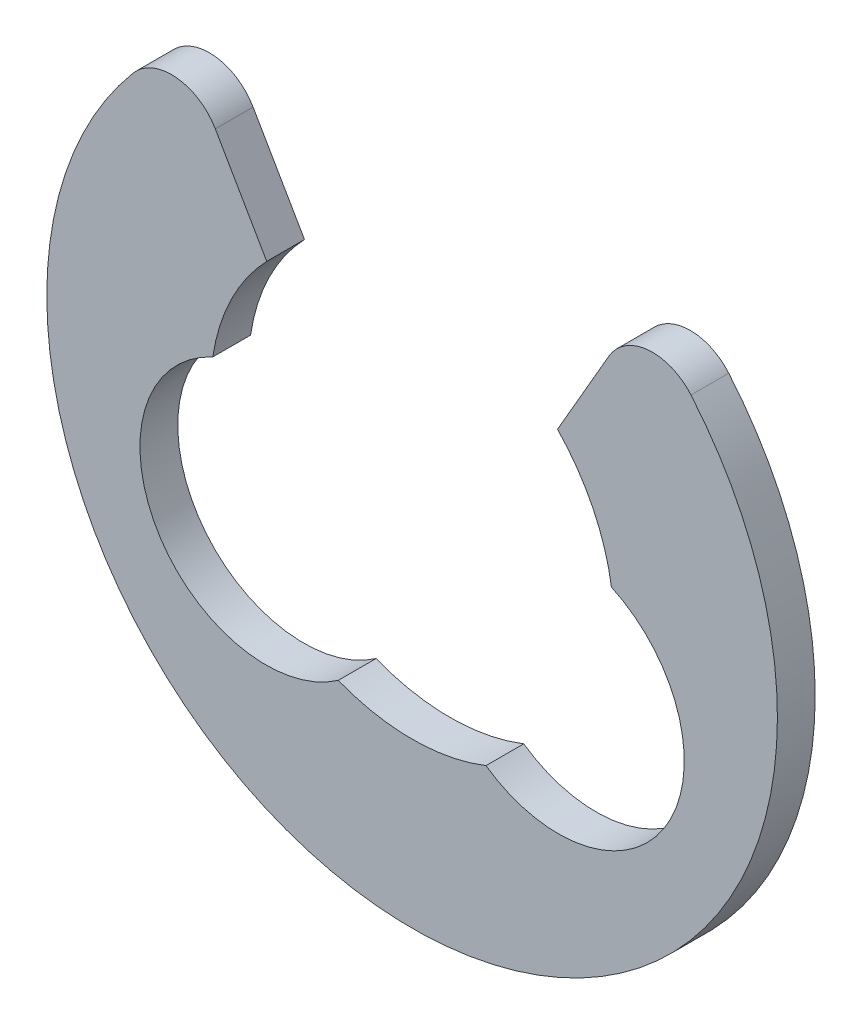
from build123d import *

# Parameters (mm, degrees)
BOSS_EXTRU_1_DEPTH = 1.5
CONG_1_R           = 2


with BuildPart() as part:
    # Esquisse1 → Boss.-Extru.1 (new body)
    with BuildSketch(Plane.XY):
        with BuildLine():
            Line((-5.771342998, 5.54), (-9.093509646, 11.294161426))
            ThreePointArc((-9.093509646, 11.294161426), (0, -14.5), (9.093509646, 11.294161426))
            Line((9.093509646, 11.294161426), (5.771342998, 5.54))
            ThreePointArc((5.771342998, 5.54), (7.180126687, 3.527857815), (7.912027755, 1.18313854))
            ThreePointArc((7.912027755, 1.18313854), (10.132497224, -5.85), (2.931385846, -7.443586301))
            ThreePointArc((2.931385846, -7.443586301), (0, -8), (-2.931385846, -7.443586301))
            ThreePointArc((-2.931385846, -7.443586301), (-10.132497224, -5.85), (-7.912027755, 1.18313854))
            ThreePointArc((-7.912027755, 1.18313854), (-7.180126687, 3.527857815), (-5.771342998, 5.54))
        make_face()
    extrude(amount=BOSS_EXTRU_1_DEPTH)

    # Cong_1
    cong_1_edges = [part.edges().sort_by_distance(p)[0] for p in [
        (9.093509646, 11.294161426, 0.75),
        (-9.093509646, 11.294161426, 0.75),
    ]]
    fillet(cong_1_edges, radius=CONG_1_R)


solid = part.part
